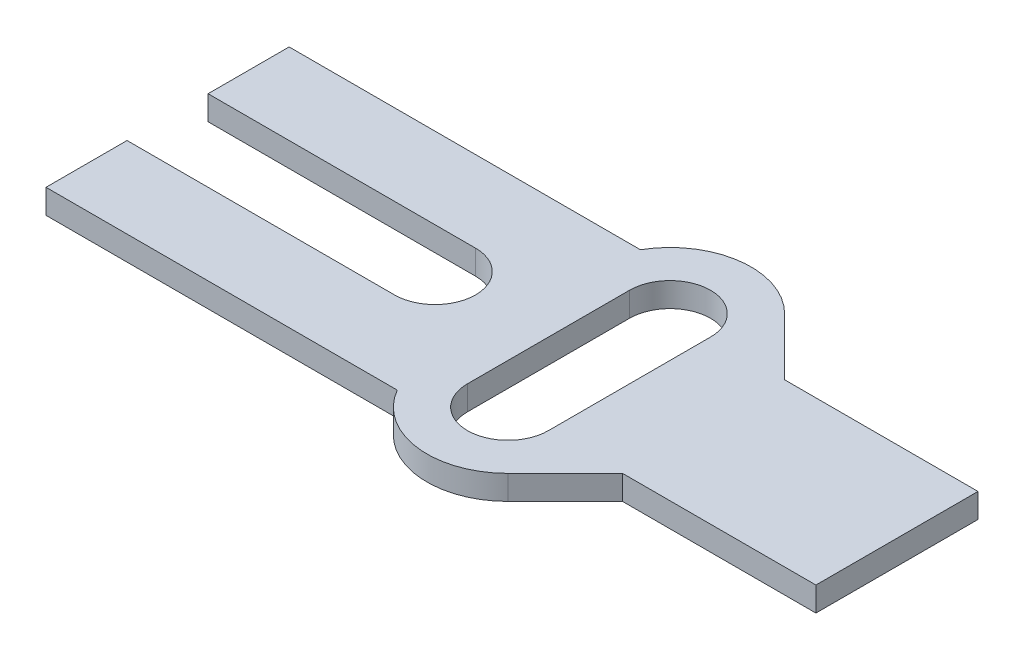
from build123d import *

# Parameters (mm, degrees)
EXTRUDE1_DEPTH = 3


with BuildPart() as part:
    # Sketch1 → Extrude1 (new body)
    with BuildSketch(Plane(origin=(0, 0, 0), x_dir=(1, 0, 0), z_dir=(0, 1, 0))):
        with BuildLine():
            Line((0, 20), (33, 20))
            ThreePointArc((33, 20), (38, 15), (33, 10))
            Line((33, 10), (0, 10))
            Line((0, 10), (0, 0))
            Line((0, 0), (43.339745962, 0))
            ThreePointArc((43.339745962, 0), (50.694738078, -4.914448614), (59.071067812, -2.071067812))
            Line((59.071067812, -2.071067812), (66.142135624, 5))
            Line((66.142135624, 5), (90, 5))
            Line((90, 5), (90, 25))
            Line((90, 25), (66.142135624, 25))
            Line((66.142135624, 25), (59.071067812, 32.071067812))
            ThreePointArc((59.071067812, 32.071067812), (50.694738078, 34.914448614), (43.339745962, 30))
            Line((43.339745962, 30), (0, 30))
            Line((0, 30), (0, 20))
        make_face()
        with BuildLine():
            Line((47, 25), (47, 5))
            ThreePointArc((47, 5), (52, 0), (57, 5))
            Line((57, 5), (57, 25))
            ThreePointArc((57, 25), (52, 30), (47, 25))
        make_face(mode=Mode.SUBTRACT)
    extrude(amount=EXTRUDE1_DEPTH)


solid = part.part
